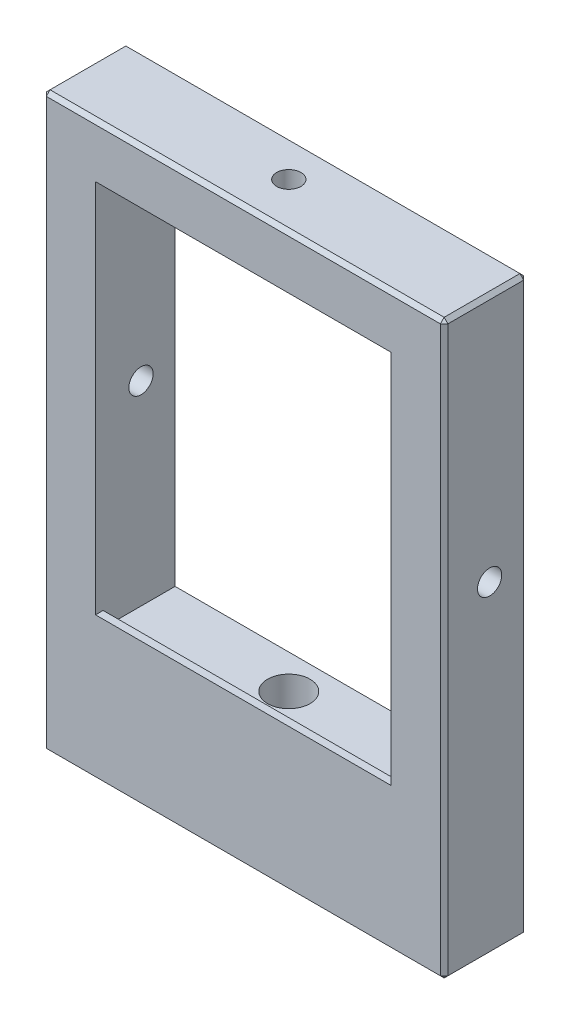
from build123d import *

# Parameters (mm, degrees)
SKETCH1_W                                   = 53
SKETCH1_H                                   = 65.5
SKETCH1_W_2                                 = 39
SKETCH1_H_2                                 = 51.5
BOSS_EXTRUDE1_DEPTH                         = 10
SKETCH2_W                                   = 53
SKETCH2_H                                   = 10
BOSS_EXTRUDE2_DEPTH                         = 10
TAP_DRILL_FOR_M4_THREADED_INSERT_TAP1_D     = 5.6
TAP_DRILL_FOR_M4_THREADED_INSERT_TAP1_DEPTH = 17
TAP_DRILL_FOR_M2_THREADED_INSERT_TAP1_D     = 3.2
TAP_DRILL_FOR_M2_THREADED_INSERT_TAP2_D     = 3.2
SKETCH10_W                                  = 53
SKETCH10_H                                  = 75.5
SKETCH10_W_2                                = 39
SKETCH10_H_2                                = 49.5
BOSS_EXTRUDE3_DEPTH                         = 1
CHAMFER1_SIZE                               = 0.5


with BuildPart() as part:
    # Sketch1 → Boss-Extrude1 (new body)
    with BuildSketch(Plane.XY):
        Rectangle(SKETCH1_W, SKETCH1_H)
        Rectangle(SKETCH1_W_2, SKETCH1_H_2, mode=Mode.SUBTRACT)
    extrude(amount=BOSS_EXTRUDE1_DEPTH)

    # Sketch2 → Boss-Extrude2 (add)
    with BuildSketch(Plane.XZ.offset(32.75)):
        with Locations((0, 5)):
            Rectangle(SKETCH2_W, SKETCH2_H)
    extrude(amount=BOSS_EXTRUDE2_DEPTH)

    # Tap Drill for M4 Threaded Insert Tap1
    with Locations(Plane(origin=(0, -42.75, 0), x_dir=(-1, 0, 0), z_dir=(0, -1, 0))):
        with Locations((0, -5)):
            Hole(TAP_DRILL_FOR_M4_THREADED_INSERT_TAP1_D / 2, depth=TAP_DRILL_FOR_M4_THREADED_INSERT_TAP1_DEPTH)

    # Tap Drill for M2 Threaded Insert Tap1 (through all)
    with Locations(Plane(origin=(26.5, 0, 0), x_dir=(0, 0, -1), z_dir=(1, 0, 0))):
        with Locations((-5, 0)):
            Hole(TAP_DRILL_FOR_M2_THREADED_INSERT_TAP1_D / 2)

    # Tap Drill for M2 Threaded Insert Tap2 (through all)
    with Locations(Plane(origin=(0, 32.75, 0), x_dir=(1, 0, 0), z_dir=(0, 1, 0))):
        with Locations((0, -5)):
            Hole(TAP_DRILL_FOR_M2_THREADED_INSERT_TAP2_D / 2)

    # Sketch10 → Boss-Extrude3 (add)
    with BuildSketch(Plane.XY.offset(10)):
        with Locations((0, -5)):
            Rectangle(SKETCH10_W, SKETCH10_H)
        with Locations((0, 1)):
            Rectangle(SKETCH10_W_2, SKETCH10_H_2, mode=Mode.SUBTRACT)
    extrude(amount=BOSS_EXTRUDE3_DEPTH)

    # Chamfer1
    chamfer1_edges = [part.edges().sort_by_distance(p)[0] for p in [
        (19.5, 0, 0),
        (0, 25.75, 0),
        (-19.5, 0, 0),
        (0, -25.75, 0),
        (-26.5, -42.75, 5.5),
        (0, -42.75, 0),
        (26.5, -42.75, 5.5),
        (-26.5, -5, 0),
        (0, 32.75, 0),
        (26.5, -5, 0),
        (0, -42.75, 11),
        (26.5, -5, 11),
        (0, 32.75, 11),
        (-26.5, -5, 11),
        (-26.5, 32.75, 5.5),
        (26.5, 32.75, 5.5),
    ]]
    chamfer(chamfer1_edges, length=CHAMFER1_SIZE)


solid = part.part
